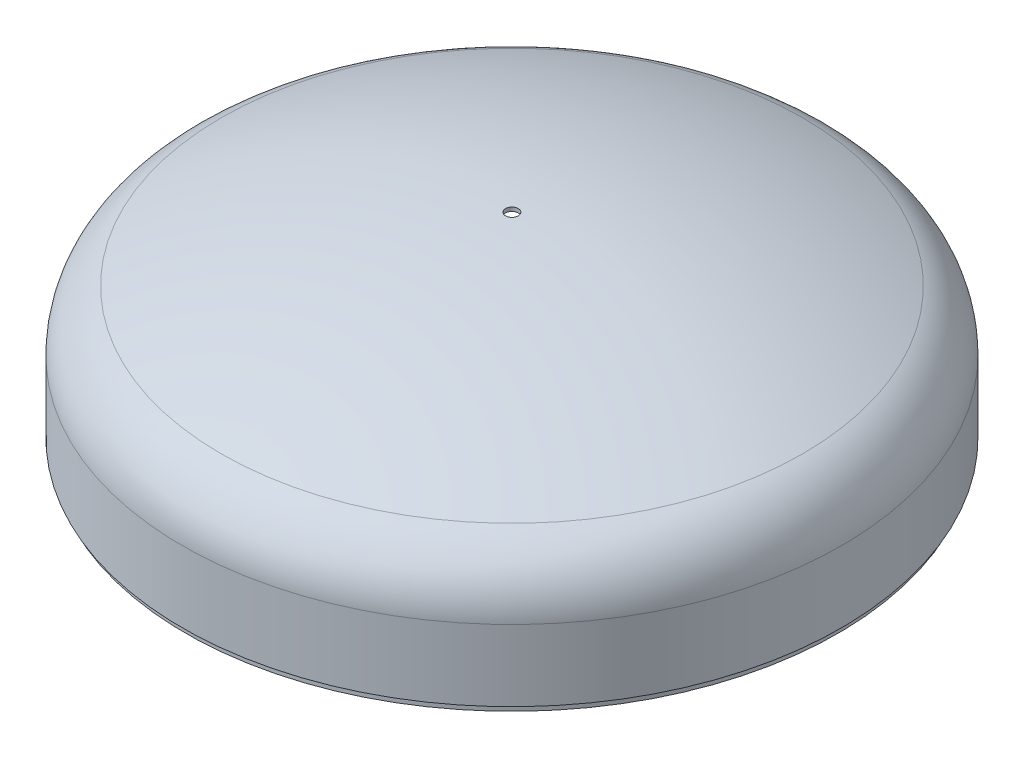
from build123d import *

# Parameters (mm, degrees)
ENL_V_MAT_EXTRU_2_DEPTH      = 800.99535497
ENL_V_MAT_EXTRU_2_DEPTH_BACK = 800.99535497
ESQUISSE2_R                  = 10


with BuildPart() as part:
    # Esquisse1 → Base-R_volution (revolve)
    with BuildSketch(Plane.XY, mode=Mode.PRIVATE) as base_r_volution_sk:
        with BuildLine():
            Line((515, 899.368111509), (515, 793.37431449))
            Line((515, 793.37431449), (511.303847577, 791.240339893))
            ThreePointArc((511.303847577, 791.240339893), (510.205771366, 790.142263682), (509.803847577, 788.642263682))
            Line((509.803847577, 788.642263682), (509.803847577, 781.37431449))
            Line((509.803847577, 781.37431449), (515.803847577, 781.37431449))
            Line((515.803847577, 781.37431449), (515.803847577, 788.37431449))
            Line((515.803847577, 788.37431449), (521, 791.37431449))
            Line((521, 791.37431449), (521, 903.863374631))
            ThreePointArc((521, 903.863374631), (504.41506443, 960.500609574), (459.899497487, 999.245941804))
            ThreePointArc((459.899497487, 999.245941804), (235.403338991, 1074.516294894), (0, 1100))
            Line((0, 1100), (0, 1094))
            ThreePointArc((0, 1094), (231.696169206, 1069.183279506), (452.880566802, 995.859022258))
            ThreePointArc((452.880566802, 995.859022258), (498.127268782, 956.746940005), (515, 899.368111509))
        make_face()
    revolve(base_r_volution_sk.sketch.rotate(Axis((0, 0, 0), (0, 1, 0)), 90), axis=Axis((0, 0, 0), (0, 1, 0)))

    # Esquisse2 → Enl_v. mat.-Extru.2 (cut, two sides: drawn at the far end of the back side and taken through both)
    with BuildSketch(Plane(origin=(0, 788.37431449, 0), x_dir=(1, 0, 0), z_dir=(0, 1, 0)).offset(-ENL_V_MAT_EXTRU_2_DEPTH_BACK)):
        Circle(ESQUISSE2_R)
    extrude(amount=ENL_V_MAT_EXTRU_2_DEPTH + ENL_V_MAT_EXTRU_2_DEPTH_BACK, mode=Mode.SUBTRACT)


solid = part.part
